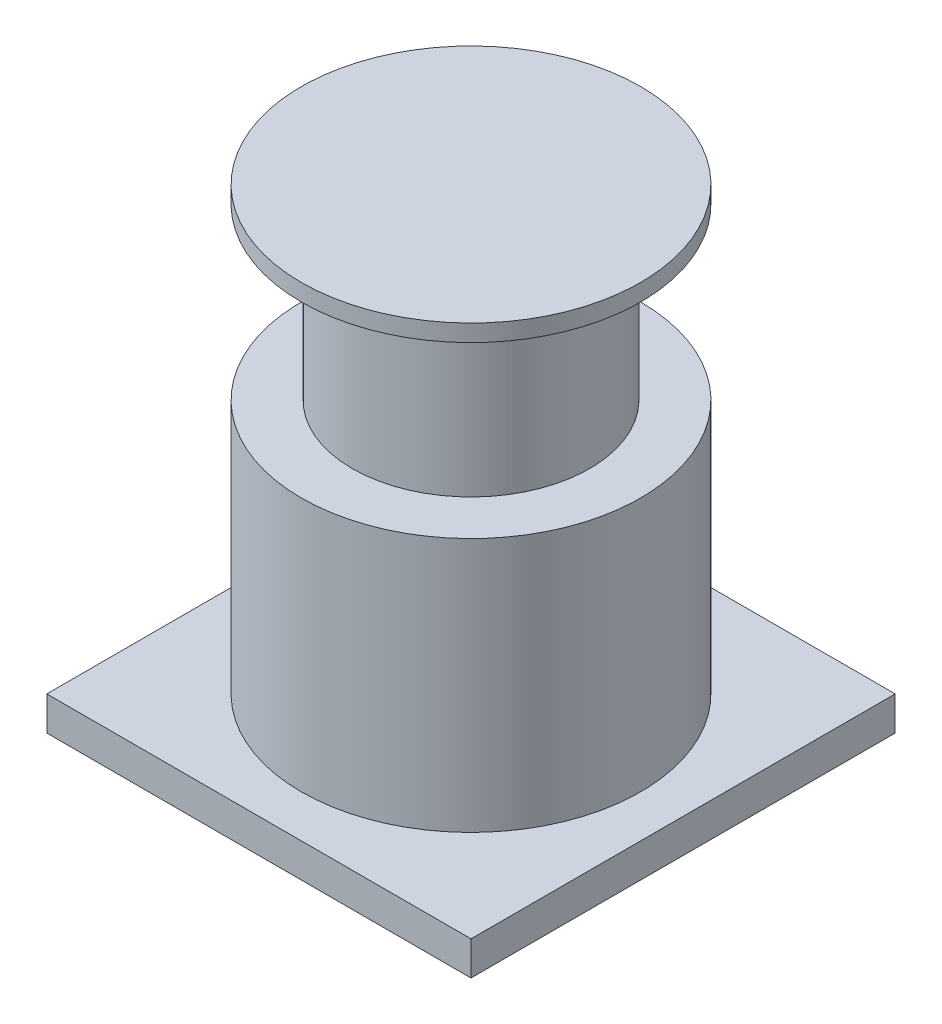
ISO-10303-21;
HEADER;
FILE_DESCRIPTION(('STEP AP214'),'2;1');
FILE_NAME('part.step','',(''),(''),'','','');
FILE_SCHEMA(('AUTOMOTIVE_DESIGN { 1 0 10303 214 1 1 1 1 }'));
ENDSEC;
DATA;
#1=APPLICATION_CONTEXT('core data for automotive mechanical design processes');
#2=APPLICATION_PROTOCOL_DEFINITION('international standard','automotive_design',2000,#1);
#3=PRODUCT_CONTEXT('',#1,'mechanical');
#4=PRODUCT('Part','Part','',(#3));
#5=PRODUCT_RELATED_PRODUCT_CATEGORY('part','',(#4));
#6=PRODUCT_DEFINITION_FORMATION('','',#4);
#7=PRODUCT_DEFINITION_CONTEXT('part definition',#1,'design');
#8=PRODUCT_DEFINITION('design','',#6,#7);
#9=PRODUCT_DEFINITION_SHAPE('','',#8);
#10=(LENGTH_UNIT() NAMED_UNIT(*) SI_UNIT(.MILLI.,.METRE.));
#11=(NAMED_UNIT(*) PLANE_ANGLE_UNIT() SI_UNIT($,.RADIAN.));
#12=(NAMED_UNIT(*) SI_UNIT($,.STERADIAN.) SOLID_ANGLE_UNIT());
#13=UNCERTAINTY_MEASURE_WITH_UNIT(LENGTH_MEASURE(1.E-05),#10,'distance_accuracy_value','');
#14=(GEOMETRIC_REPRESENTATION_CONTEXT(3) GLOBAL_UNCERTAINTY_ASSIGNED_CONTEXT((#13)) GLOBAL_UNIT_ASSIGNED_CONTEXT((#10,
#11,#12)) REPRESENTATION_CONTEXT('',''));
#15=CARTESIAN_POINT('',(0.,0.,0.));
#16=DIRECTION('',(0.,0.,1.));
#17=DIRECTION('',(1.,0.,0.));
#18=AXIS2_PLACEMENT_3D('',#15,#16,#17);
#19=CARTESIAN_POINT('',(-78.1893004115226,20.,163.168724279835));
#20=DIRECTION('',(1.,0.,0.));
#21=DIRECTION('',(0.,0.,-1.));
#22=AXIS2_PLACEMENT_3D('',#19,#20,#21);
#23=PLANE('',#22);
#24=DIRECTION('',(0.,0.,1.));
#25=VECTOR('',#24,1.);
#26=CARTESIAN_POINT('',(-78.1893004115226,0.,163.168724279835));
#27=LINE('',#26,#25);
#28=CARTESIAN_POINT('',(-78.1893004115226,0.,-86.8312757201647));
#29=VERTEX_POINT('',#28);
#30=CARTESIAN_POINT('',(-78.1893004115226,0.,163.168724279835));
#31=VERTEX_POINT('',#30);
#32=EDGE_CURVE('E106',#29,#31,#27,.T.);
#33=ORIENTED_EDGE('',*,*,#32,.T.);
#34=DIRECTION('',(0.,-1.,0.));
#35=VECTOR('',#34,1.);
#36=CARTESIAN_POINT('',(-78.1893004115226,20.,163.168724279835));
#37=LINE('',#36,#35);
#38=CARTESIAN_POINT('',(-78.1893004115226,20.,163.168724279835));
#39=VERTEX_POINT('',#38);
#40=EDGE_CURVE('E42',#39,#31,#37,.T.);
#41=ORIENTED_EDGE('',*,*,#40,.F.);
#42=DIRECTION('',(0.,0.,1.));
#43=VECTOR('',#42,1.);
#44=CARTESIAN_POINT('',(-78.1893004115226,20.,163.168724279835));
#45=LINE('',#44,#43);
#46=CARTESIAN_POINT('',(-78.1893004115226,20.,-86.8312757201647));
#47=VERTEX_POINT('',#46);
#48=EDGE_CURVE('E93',#47,#39,#45,.T.);
#49=ORIENTED_EDGE('',*,*,#48,.F.);
#50=DIRECTION('',(0.,-1.,0.));
#51=VECTOR('',#50,1.);
#52=CARTESIAN_POINT('',(-78.1893004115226,20.,-86.8312757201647));
#53=LINE('',#52,#51);
#54=EDGE_CURVE('E102',#47,#29,#53,.T.);
#55=ORIENTED_EDGE('',*,*,#54,.T.);
#56=EDGE_LOOP('',(#33,#41,#49,#55));
#57=FACE_BOUND('',#56,.T.);
#58=ADVANCED_FACE('F39',(#57),#23,.F.);
#59=CARTESIAN_POINT('',(-78.1893004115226,20.,163.168724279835));
#60=DIRECTION('',(0.,0.,-1.));
#61=DIRECTION('',(-1.,0.,0.));
#62=AXIS2_PLACEMENT_3D('',#59,#60,#61);
#63=PLANE('',#62);
#64=DIRECTION('',(1.,0.,0.));
#65=VECTOR('',#64,1.);
#66=CARTESIAN_POINT('',(-78.1893004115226,0.,163.168724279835));
#67=LINE('',#66,#65);
#68=CARTESIAN_POINT('',(171.810699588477,0.,163.168724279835));
#69=VERTEX_POINT('',#68);
#70=EDGE_CURVE('E98',#31,#69,#67,.T.);
#71=ORIENTED_EDGE('',*,*,#70,.T.);
#72=DIRECTION('',(0.,-1.,0.));
#73=VECTOR('',#72,1.);
#74=CARTESIAN_POINT('',(171.810699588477,20.,163.168724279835));
#75=LINE('',#74,#73);
#76=CARTESIAN_POINT('',(171.810699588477,20.,163.168724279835));
#77=VERTEX_POINT('',#76);
#78=EDGE_CURVE('E96',#77,#69,#75,.T.);
#79=ORIENTED_EDGE('',*,*,#78,.F.);
#80=DIRECTION('',(1.,0.,0.));
#81=VECTOR('',#80,1.);
#82=CARTESIAN_POINT('',(-78.1893004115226,20.,163.168724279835));
#83=LINE('',#82,#81);
#84=EDGE_CURVE('E88',#39,#77,#83,.T.);
#85=ORIENTED_EDGE('',*,*,#84,.F.);
#86=ORIENTED_EDGE('',*,*,#40,.T.);
#87=EDGE_LOOP('',(#71,#79,#85,#86));
#88=FACE_BOUND('',#87,.T.);
#89=ADVANCED_FACE('F97',(#88),#63,.F.);
#90=CARTESIAN_POINT('',(171.810699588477,20.,163.168724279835));
#91=DIRECTION('',(-1.,0.,0.));
#92=DIRECTION('',(0.,0.,1.));
#93=AXIS2_PLACEMENT_3D('',#90,#91,#92);
#94=PLANE('',#93);
#95=DIRECTION('',(0.,0.,-1.));
#96=VECTOR('',#95,1.);
#97=CARTESIAN_POINT('',(171.810699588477,0.,163.168724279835));
#98=LINE('',#97,#96);
#99=CARTESIAN_POINT('',(171.810699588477,0.,-86.8312757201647));
#100=VERTEX_POINT('',#99);
#101=EDGE_CURVE('E74',#69,#100,#98,.T.);
#102=ORIENTED_EDGE('',*,*,#101,.T.);
#103=DIRECTION('',(0.,-1.,0.));
#104=VECTOR('',#103,1.);
#105=CARTESIAN_POINT('',(171.810699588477,20.,-86.8312757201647));
#106=LINE('',#105,#104);
#107=CARTESIAN_POINT('',(171.810699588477,20.,-86.8312757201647));
#108=VERTEX_POINT('',#107);
#109=EDGE_CURVE('E99',#108,#100,#106,.T.);
#110=ORIENTED_EDGE('',*,*,#109,.F.);
#111=DIRECTION('',(0.,0.,-1.));
#112=VECTOR('',#111,1.);
#113=CARTESIAN_POINT('',(171.810699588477,20.,163.168724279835));
#114=LINE('',#113,#112);
#115=EDGE_CURVE('E91',#77,#108,#114,.T.);
#116=ORIENTED_EDGE('',*,*,#115,.F.);
#117=ORIENTED_EDGE('',*,*,#78,.T.);
#118=EDGE_LOOP('',(#102,#110,#116,#117));
#119=FACE_BOUND('',#118,.T.);
#120=ADVANCED_FACE('F100',(#119),#94,.F.);
#121=CARTESIAN_POINT('',(-78.1893004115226,20.,-86.8312757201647));
#122=DIRECTION('',(0.,0.,1.));
#123=DIRECTION('',(1.,0.,0.));
#124=AXIS2_PLACEMENT_3D('',#121,#122,#123);
#125=PLANE('',#124);
#126=DIRECTION('',(-1.,0.,0.));
#127=VECTOR('',#126,1.);
#128=CARTESIAN_POINT('',(-78.1893004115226,0.,-86.8312757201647));
#129=LINE('',#128,#127);
#130=EDGE_CURVE('E80',#100,#29,#129,.T.);
#131=ORIENTED_EDGE('',*,*,#130,.T.);
#132=ORIENTED_EDGE('',*,*,#54,.F.);
#133=DIRECTION('',(-1.,0.,0.));
#134=VECTOR('',#133,1.);
#135=CARTESIAN_POINT('',(-78.1893004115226,20.,-86.8312757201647));
#136=LINE('',#135,#134);
#137=EDGE_CURVE('E57',#108,#47,#136,.T.);
#138=ORIENTED_EDGE('',*,*,#137,.F.);
#139=ORIENTED_EDGE('',*,*,#109,.T.);
#140=EDGE_LOOP('',(#131,#132,#138,#139));
#141=FACE_BOUND('',#140,.T.);
#142=ADVANCED_FACE('F114',(#141),#125,.F.);
#143=CARTESIAN_POINT('',(0.,20.,0.));
#144=DIRECTION('',(0.,-1.,0.));
#145=DIRECTION('',(0.,0.,-1.));
#146=AXIS2_PLACEMENT_3D('',#143,#144,#145);
#147=PLANE('',#146);
#148=CARTESIAN_POINT('',(46.8106995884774,20.,38.1687242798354));
#149=DIRECTION('',(0.,1.,0.));
#150=DIRECTION('',(0.,0.,1.));
#151=AXIS2_PLACEMENT_3D('',#148,#149,#150);
#152=CIRCLE('',#151,100.);
#153=CARTESIAN_POINT('',(46.8106995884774,20.,138.168724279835));
#154=VERTEX_POINT('',#153);
#155=EDGE_CURVE('E48',#154,#154,#152,.T.);
#156=ORIENTED_EDGE('',*,*,#155,.F.);
#157=EDGE_LOOP('',(#156));
#158=FACE_BOUND('',#157,.T.);
#159=ORIENTED_EDGE('',*,*,#48,.T.);
#160=ORIENTED_EDGE('',*,*,#84,.T.);
#161=ORIENTED_EDGE('',*,*,#115,.T.);
#162=ORIENTED_EDGE('',*,*,#137,.T.);
#163=EDGE_LOOP('',(#159,#160,#161,#162));
#164=FACE_BOUND('',#163,.T.);
#165=ADVANCED_FACE('F89',(#158,#164),#147,.F.);
#166=CARTESIAN_POINT('',(0.,0.,0.));
#167=DIRECTION('',(0.,-1.,0.));
#168=DIRECTION('',(0.,0.,-1.));
#169=AXIS2_PLACEMENT_3D('',#166,#167,#168);
#170=PLANE('',#169);
#171=ORIENTED_EDGE('',*,*,#32,.F.);
#172=ORIENTED_EDGE('',*,*,#130,.F.);
#173=ORIENTED_EDGE('',*,*,#101,.F.);
#174=ORIENTED_EDGE('',*,*,#70,.F.);
#175=EDGE_LOOP('',(#171,#172,#173,#174));
#176=FACE_BOUND('',#175,.T.);
#177=ADVANCED_FACE('F117',(#176),#170,.T.);
#178=CARTESIAN_POINT('',(46.8106995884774,170.,38.1687242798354));
#179=DIRECTION('',(0.,-1.,0.));
#180=DIRECTION('',(0.,0.,-1.));
#181=AXIS2_PLACEMENT_3D('',#178,#179,#180);
#182=CYLINDRICAL_SURFACE('',#181,100.);
#183=CARTESIAN_POINT('',(46.8106995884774,170.,38.1687242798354));
#184=DIRECTION('',(0.,1.,0.));
#185=DIRECTION('',(0.,0.,1.));
#186=AXIS2_PLACEMENT_3D('',#183,#184,#185);
#187=CIRCLE('',#186,100.);
#188=CARTESIAN_POINT('',(46.8106995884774,170.,138.168724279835));
#189=VERTEX_POINT('',#188);
#190=EDGE_CURVE('E109',#189,#189,#187,.T.);
#191=ORIENTED_EDGE('',*,*,#190,.F.);
#192=EDGE_LOOP('',(#191));
#193=FACE_BOUND('',#192,.T.);
#194=ORIENTED_EDGE('',*,*,#155,.T.);
#195=EDGE_LOOP('',(#194));
#196=FACE_BOUND('',#195,.T.);
#197=ADVANCED_FACE('F164',(#193,#196),#182,.T.);
#198=CARTESIAN_POINT('',(46.8106995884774,170.,38.1687242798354));
#199=DIRECTION('',(0.,1.,0.));
#200=DIRECTION('',(0.,0.,1.));
#201=AXIS2_PLACEMENT_3D('',#198,#199,#200);
#202=PLANE('',#201);
#203=CARTESIAN_POINT('',(46.8106995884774,170.,38.1687242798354));
#204=DIRECTION('',(0.,1.,0.));
#205=DIRECTION('',(0.,0.,1.));
#206=AXIS2_PLACEMENT_3D('',#203,#204,#205);
#207=CIRCLE('',#206,70.);
#208=CARTESIAN_POINT('',(46.8106995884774,170.,108.168724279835));
#209=VERTEX_POINT('',#208);
#210=EDGE_CURVE('E11',#209,#209,#207,.T.);
#211=ORIENTED_EDGE('',*,*,#210,.F.);
#212=EDGE_LOOP('',(#211));
#213=FACE_BOUND('',#212,.T.);
#214=ORIENTED_EDGE('',*,*,#190,.T.);
#215=EDGE_LOOP('',(#214));
#216=FACE_BOUND('',#215,.T.);
#217=ADVANCED_FACE('F170',(#213,#216),#202,.T.);
#218=CARTESIAN_POINT('',(46.8106995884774,270.,38.1687242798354));
#219=DIRECTION('',(0.,-1.,0.));
#220=DIRECTION('',(0.,0.,-1.));
#221=AXIS2_PLACEMENT_3D('',#218,#219,#220);
#222=CYLINDRICAL_SURFACE('',#221,70.);
#223=CARTESIAN_POINT('',(46.8106995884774,270.,38.1687242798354));
#224=DIRECTION('',(0.,1.,0.));
#225=DIRECTION('',(0.,0.,1.));
#226=AXIS2_PLACEMENT_3D('',#223,#224,#225);
#227=CIRCLE('',#226,70.);
#228=CARTESIAN_POINT('',(46.8106995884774,270.,108.168724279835));
#229=VERTEX_POINT('',#228);
#230=EDGE_CURVE('E123',#229,#229,#227,.T.);
#231=ORIENTED_EDGE('',*,*,#230,.F.);
#232=EDGE_LOOP('',(#231));
#233=FACE_BOUND('',#232,.T.);
#234=ORIENTED_EDGE('',*,*,#210,.T.);
#235=EDGE_LOOP('',(#234));
#236=FACE_BOUND('',#235,.T.);
#237=ADVANCED_FACE('F139',(#233,#236),#222,.T.);
#238=CARTESIAN_POINT('',(46.8106995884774,280.,38.1687242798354));
#239=DIRECTION('',(0.,-1.,0.));
#240=DIRECTION('',(0.,0.,-1.));
#241=AXIS2_PLACEMENT_3D('',#238,#239,#240);
#242=CYLINDRICAL_SURFACE('',#241,100.);
#243=CARTESIAN_POINT('',(46.8106995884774,280.,38.1687242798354));
#244=DIRECTION('',(0.,1.,0.));
#245=DIRECTION('',(0.,0.,1.));
#246=AXIS2_PLACEMENT_3D('',#243,#244,#245);
#247=CIRCLE('',#246,100.);
#248=CARTESIAN_POINT('',(46.8106995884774,280.,138.168724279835));
#249=VERTEX_POINT('',#248);
#250=EDGE_CURVE('E127',#249,#249,#247,.T.);
#251=ORIENTED_EDGE('',*,*,#250,.F.);
#252=EDGE_LOOP('',(#251));
#253=FACE_BOUND('',#252,.T.);
#254=CARTESIAN_POINT('',(46.8106995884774,270.,38.1687242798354));
#255=DIRECTION('',(0.,1.,0.));
#256=DIRECTION('',(0.,0.,1.));
#257=AXIS2_PLACEMENT_3D('',#254,#255,#256);
#258=CIRCLE('',#257,100.);
#259=CARTESIAN_POINT('',(46.8106995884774,270.,138.168724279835));
#260=VERTEX_POINT('',#259);
#261=EDGE_CURVE('E128',#260,#260,#258,.T.);
#262=ORIENTED_EDGE('',*,*,#261,.T.);
#263=EDGE_LOOP('',(#262));
#264=FACE_BOUND('',#263,.T.);
#265=ADVANCED_FACE('F136',(#253,#264),#242,.T.);
#266=CARTESIAN_POINT('',(46.8106995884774,280.,38.1687242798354));
#267=DIRECTION('',(0.,1.,0.));
#268=DIRECTION('',(0.,0.,1.));
#269=AXIS2_PLACEMENT_3D('',#266,#267,#268);
#270=PLANE('',#269);
#271=ORIENTED_EDGE('',*,*,#250,.T.);
#272=EDGE_LOOP('',(#271));
#273=FACE_BOUND('',#272,.T.);
#274=ADVANCED_FACE('F134',(#273),#270,.T.);
#275=CARTESIAN_POINT('',(46.8106995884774,270.,38.1687242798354));
#276=DIRECTION('',(0.,1.,0.));
#277=DIRECTION('',(0.,0.,1.));
#278=AXIS2_PLACEMENT_3D('',#275,#276,#277);
#279=PLANE('',#278);
#280=ORIENTED_EDGE('',*,*,#230,.T.);
#281=EDGE_LOOP('',(#280));
#282=FACE_BOUND('',#281,.T.);
#283=ORIENTED_EDGE('',*,*,#261,.F.);
#284=EDGE_LOOP('',(#283));
#285=FACE_BOUND('',#284,.T.);
#286=ADVANCED_FACE('F143',(#282,#285),#279,.F.);
#287=CLOSED_SHELL('',(#58,#89,#120,#142,#165,#177,#197,#217,#237,#265,#274,#286));
#288=MANIFOLD_SOLID_BREP('B2',#287);
#289=ADVANCED_BREP_SHAPE_REPRESENTATION('',(#18,#288),#14);
#290=SHAPE_DEFINITION_REPRESENTATION(#9,#289);
ENDSEC;
END-ISO-10303-21;
